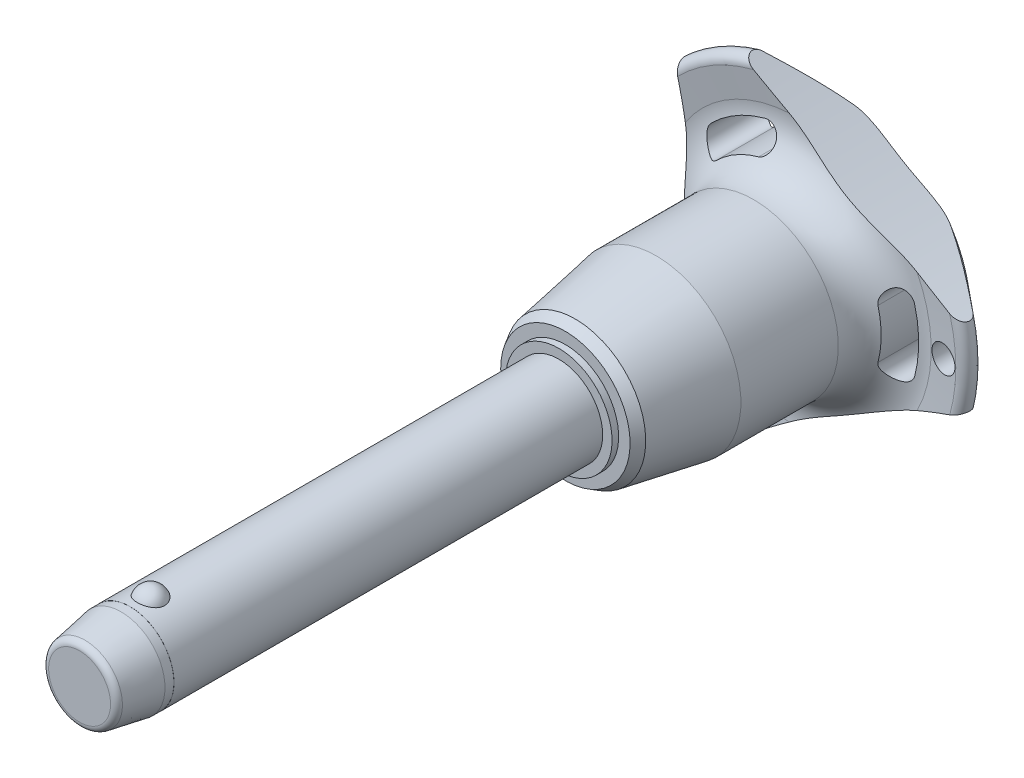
from build123d import *

# Parameters (mm, degrees)
SKETCH1_R           = 5
BOSS_EXTRUDE1_DEPTH = 45
SKETCH2_R           = 4.25
BOSS_EXTRUDE2_DEPTH = 33.3
BOSS_EXTRUDE3_START = 9.6
SKETCH1_2_R         = 5
BOSS_EXTRUDE3_DEPTH = 9.6
CHAMFER1_SIZE       = 4.8
CHAMFER1_SIZE2      = 0.846369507
FILLET1_R           = 0.75
SKETCH6_R           = 102.8
CUT_EXTRUDE1_DEPTH  = 84.064879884
CIRPATTERN1_COUNT   = 3
SKETCH7_R           = 1.5
CUT_EXTRUDE2_DEPTH  = 83.869938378
SKETCH8_R           = 5
SKETCH8_R_2         = 4.99
CUT_EXTRUDE3_DEPTH  = 5.76


with BuildPart() as part:
    # Sketch1 → Boss-Extrude1 (new body)
    with BuildSketch(Plane.XY):
        Circle(SKETCH1_R)
    extrude(amount=-BOSS_EXTRUDE1_DEPTH)

    # Sketch2 → Boss-Extrude2 (add)
    with BuildSketch(Plane(origin=(0, 0, -45), x_dir=(-1, 0, 0), z_dir=(0, 0, -1))):
        Circle(SKETCH2_R)
    extrude(amount=BOSS_EXTRUDE2_DEPTH)

    # Sketch3 → Revolve1 (revolve)
    with BuildSketch(Plane(origin=(0, 0, 0), x_dir=(0, 0, -1), z_dir=(1, 0, 0))):
        with BuildLine():
            Line((-1.516575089, 6), (-1.516575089, 2.7))
            ThreePointArc((-1.516575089, 2.7), (0.133424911, 4.35), (-1.516575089, 6))
        make_face()
        with BuildLine():
            Line((-1.516575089, -2.7), (-1.516575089, -6))
            ThreePointArc((-1.516575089, -6), (0.133424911, -4.35), (-1.516575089, -2.7))
        make_face()
    revolve(axis=Axis((0, -2.7, 1.516575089), (0, 1, 0)))

    # Sketch1_2 → Boss-Extrude3 (add)
    with BuildSketch(Plane.XY.offset(BOSS_EXTRUDE3_START)):
        Circle(SKETCH1_2_R)
    extrude(amount=-BOSS_EXTRUDE3_DEPTH)

    # Chamfer1
    chamfer1_edges = [part.edges().sort_by_distance(p)[0] for p in [
        (-5, 0, 9.6),
    ]]
    chamfer1_side = [part.faces().sort_by_distance(p)[0] for p in [
        (-5, 0, -17.7),
    ]]
    chamfer(chamfer1_edges, length=CHAMFER1_SIZE, length2=CHAMFER1_SIZE2, reference=chamfer1_side[0])

    # Fillet1
    fillet1_edges = [part.edges().sort_by_distance(p)[0] for p in [
        (-4.153630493, 0, 9.6),
        (4.25, 0, -78.3),
    ]]
    fillet(fillet1_edges, radius=FILLET1_R)

    # Sketch4 → Revolve2 (revolve)
    with BuildSketch(Plane(origin=(0, 0, 0), x_dir=(0, 0, -1), z_dir=(1, 0, 0)), mode=Mode.PRIVATE) as revolve2_sk:
        Polygon((45, 0), (45, 6.067402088), (45.75, 6.067402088), (45.75, 7.371950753), (46.879772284, 8.024225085), (56.1, 9.65), (67.2, 9.65), (67.2, 0), align=None)
    revolve(revolve2_sk.sketch.rotate(Axis((0, 0, -67.2), (0, 0, 1)), 90), axis=Axis((0, 0, -67.2), (0, 0, 1)))

    # Sketch5 → Revolve3 (revolve)
    with BuildSketch(Plane(origin=(0, 0, 0), x_dir=(0, 0, -1), z_dir=(1, 0, 0)), mode=Mode.PRIVATE) as revolve3_sk:
        with BuildLine():
            Line((72.16082631, 15.274661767), (71.757834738, 18.475067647))
            ThreePointArc((71.757834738, 18.475067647), (72.349836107, 19.516443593), (73.516044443, 19.24278761))
            Line((73.516044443, 19.24278761), (77.835691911, 14.094832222))
            ThreePointArc((77.835691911, 14.094832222), (78.3, 12.689260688), (77.67067517, 11.349423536))
            ThreePointArc((77.67067517, 11.349423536), (74.033110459, 6.185112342), (72.75, 0))
            Line((72.75, 0), (67.2, 0))
            Line((67.2, 0), (67.2, 9.65))
            ThreePointArc((67.2, 9.65), (70.949887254, 11.342683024), (72.16082631, 15.274661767))
        make_face()
    revolve(revolve3_sk.sketch.rotate(Axis((0, 0, -72.75), (0, 0, 1)), 90), axis=Axis((0, 0, -72.75), (0, 0, 1)))

    # Sketch6 → Cut-Extrude1 (cut, through all)
    with BuildSketch(Plane.XY):
        with Locations((-115.2, 0)):
            Circle(SKETCH6_R)
        with BuildLine():
            ThreePointArc((13.411913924, -3.529271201), (13.868496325, 0), (13.411913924, 3.529271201))
            ThreePointArc((13.411913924, 3.529271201), (11.694200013, 4.531299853), (10.692171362, 2.813585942))
            ThreePointArc((10.692171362, 2.813585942), (11.056165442, 0), (10.692171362, -2.813585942))
            ThreePointArc((10.692171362, -2.813585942), (11.694200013, -4.531299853), (13.411913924, -3.529271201))
        make_face()
    cut_extrude1 = extrude(amount=-CUT_EXTRUDE1_DEPTH, mode=Mode.SUBTRACT)

    # CirPattern1: Cut-Extrude1 ×3 about axis
    cirpattern1_axis = Axis((0, 0, 0), (0, 0, 1))
    for i in range(1, CIRPATTERN1_COUNT):
        add(cut_extrude1.rotate(cirpattern1_axis, i * 360 / CIRPATTERN1_COUNT), mode=Mode.SUBTRACT)

    # Sketch7 → Cut-Extrude2 (cut, through all)
    with BuildSketch(Plane.XY):
        with Locations(Location((16.868496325, 0, 0), (0, 0, 225.467095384))):
            Circle(SKETCH7_R)
    extrude(amount=-CUT_EXTRUDE2_DEPTH, mode=Mode.SUBTRACT)

    # Sketch8 → Cut-Extrude3 (cut)
    with BuildSketch(Plane.XY.offset(9.6)):
        Circle(SKETCH8_R)
        Circle(SKETCH8_R_2, mode=Mode.SUBTRACT)
    extrude(amount=-CUT_EXTRUDE3_DEPTH, mode=Mode.SUBTRACT)


solid = part.part
